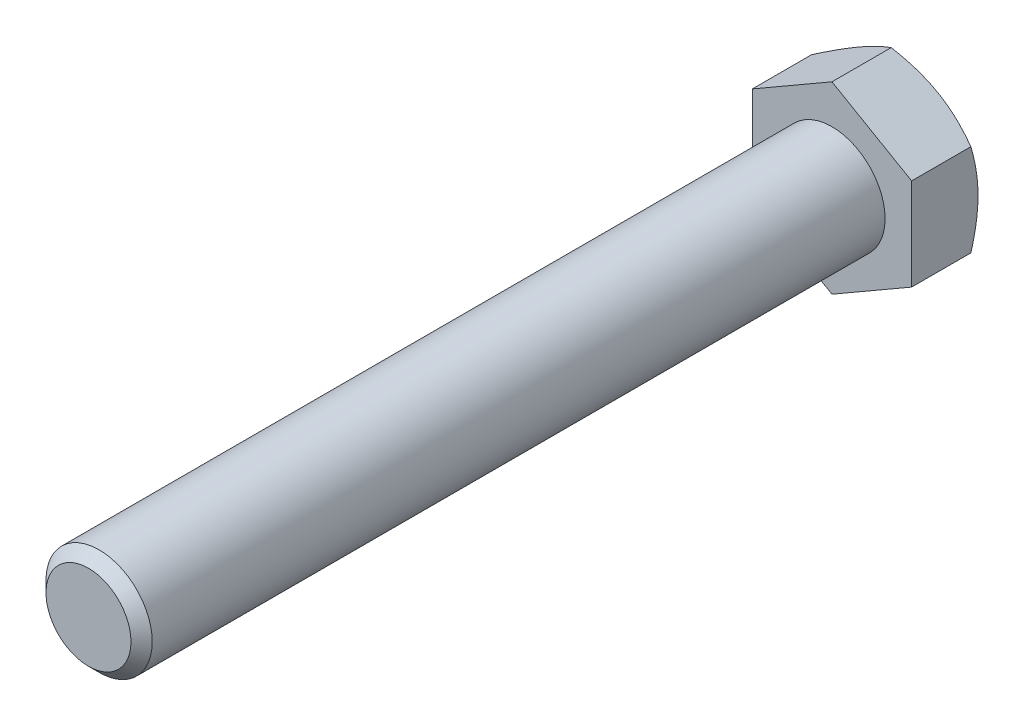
ISO-10303-21;
HEADER;
FILE_DESCRIPTION(('STEP AP214'),'2;1');
FILE_NAME('part.step','',(''),(''),'','','');
FILE_SCHEMA(('AUTOMOTIVE_DESIGN { 1 0 10303 214 1 1 1 1 }'));
ENDSEC;
DATA;
#1=APPLICATION_CONTEXT('core data for automotive mechanical design processes');
#2=APPLICATION_PROTOCOL_DEFINITION('international standard','automotive_design',2000,#1);
#3=PRODUCT_CONTEXT('',#1,'mechanical');
#4=PRODUCT('Part','Part','',(#3));
#5=PRODUCT_RELATED_PRODUCT_CATEGORY('part','',(#4));
#6=PRODUCT_DEFINITION_FORMATION('','',#4);
#7=PRODUCT_DEFINITION_CONTEXT('part definition',#1,'design');
#8=PRODUCT_DEFINITION('design','',#6,#7);
#9=PRODUCT_DEFINITION_SHAPE('','',#8);
#10=(LENGTH_UNIT() NAMED_UNIT(*) SI_UNIT(.MILLI.,.METRE.));
#11=(NAMED_UNIT(*) PLANE_ANGLE_UNIT() SI_UNIT($,.RADIAN.));
#12=(NAMED_UNIT(*) SI_UNIT($,.STERADIAN.) SOLID_ANGLE_UNIT());
#13=UNCERTAINTY_MEASURE_WITH_UNIT(LENGTH_MEASURE(1.E-05),#10,'distance_accuracy_value','');
#14=(GEOMETRIC_REPRESENTATION_CONTEXT(3) GLOBAL_UNCERTAINTY_ASSIGNED_CONTEXT((#13)) GLOBAL_UNIT_ASSIGNED_CONTEXT((#10,
#11,#12)) REPRESENTATION_CONTEXT('',''));
#15=CARTESIAN_POINT('',(0.,0.,0.));
#16=DIRECTION('',(0.,0.,1.));
#17=DIRECTION('',(1.,0.,0.));
#18=AXIS2_PLACEMENT_3D('',#15,#16,#17);
#19=CARTESIAN_POINT('',(0.,0.,140.));
#20=DIRECTION('',(0.,0.,1.));
#21=DIRECTION('',(1.,0.,0.));
#22=AXIS2_PLACEMENT_3D('',#19,#20,#21);
#23=PLANE('',#22);
#24=CARTESIAN_POINT('',(0.,0.,140.));
#25=DIRECTION('',(0.,0.,1.));
#26=DIRECTION('',(1.,0.,0.));
#27=AXIS2_PLACEMENT_3D('',#24,#25,#26);
#28=CIRCLE('',#27,8.00000000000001);
#29=CARTESIAN_POINT('',(8.00000000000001,0.,140.));
#30=VERTEX_POINT('',#29);
#31=EDGE_CURVE('E201',#30,#30,#28,.T.);
#32=ORIENTED_EDGE('',*,*,#31,.T.);
#33=EDGE_LOOP('',(#32));
#34=FACE_BOUND('',#33,.T.);
#35=ADVANCED_FACE('F27',(#34),#23,.T.);
#36=CARTESIAN_POINT('',(0.,0.,0.));
#37=DIRECTION('',(0.,0.,1.));
#38=DIRECTION('',(1.,0.,0.));
#39=AXIS2_PLACEMENT_3D('',#36,#37,#38);
#40=CYLINDRICAL_SURFACE('',#39,10.);
#41=CARTESIAN_POINT('',(0.,0.,138.));
#42=DIRECTION('',(0.,0.,1.));
#43=DIRECTION('',(1.,0.,0.));
#44=AXIS2_PLACEMENT_3D('',#41,#42,#43);
#45=CIRCLE('',#44,10.);
#46=CARTESIAN_POINT('',(10.,0.,138.));
#47=VERTEX_POINT('',#46);
#48=EDGE_CURVE('E203',#47,#47,#45,.F.);
#49=ORIENTED_EDGE('',*,*,#48,.T.);
#50=EDGE_LOOP('',(#49));
#51=FACE_BOUND('',#50,.T.);
#52=CARTESIAN_POINT('',(0.,0.,0.));
#53=DIRECTION('',(0.,0.,1.));
#54=DIRECTION('',(1.,0.,0.));
#55=AXIS2_PLACEMENT_3D('',#52,#53,#54);
#56=CIRCLE('',#55,10.);
#57=CARTESIAN_POINT('',(10.,0.,0.));
#58=VERTEX_POINT('',#57);
#59=EDGE_CURVE('E204',#58,#58,#56,.F.);
#60=ORIENTED_EDGE('',*,*,#59,.F.);
#61=EDGE_LOOP('',(#60));
#62=FACE_BOUND('',#61,.T.);
#63=ADVANCED_FACE('F192',(#51,#62),#40,.T.);
#64=CARTESIAN_POINT('',(0.,0.,140.));
#65=DIRECTION('',(0.,0.,-1.));
#66=DIRECTION('',(-1.,0.,0.));
#67=AXIS2_PLACEMENT_3D('',#64,#65,#66);
#68=CONICAL_SURFACE('',#67,8.00000000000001,0.785398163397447);
#69=ORIENTED_EDGE('',*,*,#48,.F.);
#70=EDGE_LOOP('',(#69));
#71=FACE_BOUND('',#70,.T.);
#72=ORIENTED_EDGE('',*,*,#31,.F.);
#73=EDGE_LOOP('',(#72));
#74=FACE_BOUND('',#73,.T.);
#75=ADVANCED_FACE('F197',(#71,#74),#68,.T.);
#76=CARTESIAN_POINT('',(-1.11022302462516E-13,17.3205080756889,-12.5));
#77=DIRECTION('',(0.499999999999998,0.86602540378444,0.));
#78=DIRECTION('',(-0.86602540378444,0.499999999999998,0.));
#79=AXIS2_PLACEMENT_3D('',#76,#77,#78);
#80=PLANE('',#79);
#81=CARTESIAN_POINT('',(-0.000200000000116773,17.3206235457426,-11.1601873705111));
#82=CARTESIAN_POINT('',(0.32949410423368,17.1302745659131,-11.270078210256));
#83=CARTESIAN_POINT('',(0.660474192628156,16.9391831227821,-11.3749824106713));
#84=CARTESIAN_POINT('',(1.32508844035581,16.5554679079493,-11.5734314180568));
#85=CARTESIAN_POINT('',(1.65872343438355,16.3628436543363,-11.6669724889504));
#86=CARTESIAN_POINT('',(2.3292922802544,15.9756905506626,-11.84143785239));
#87=CARTESIAN_POINT('',(2.66623200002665,15.7811583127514,-11.9223322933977));
#88=CARTESIAN_POINT('',(3.34245276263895,15.3907420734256,-12.0697673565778));
#89=CARTESIAN_POINT('',(3.68173367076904,15.1948581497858,-12.1363087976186));
#90=CARTESIAN_POINT('',(4.35394314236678,14.806757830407,-12.2522076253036));
#91=CARTESIAN_POINT('',(4.68682180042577,14.6145702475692,-12.3019486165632));
#92=CARTESIAN_POINT('',(5.35410443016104,14.229314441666,-12.3853532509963));
#93=CARTESIAN_POINT('',(5.68850843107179,14.036246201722,-12.4190165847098));
#94=CARTESIAN_POINT('',(6.35787818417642,13.6497853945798,-12.4694159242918));
#95=CARTESIAN_POINT('',(6.69284279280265,13.4563934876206,-12.4861720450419));
#96=CARTESIAN_POINT('',(7.36308121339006,13.0694311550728,-12.502396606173));
#97=CARTESIAN_POINT('',(7.69835501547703,12.8758607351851,-12.5018655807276));
#98=CARTESIAN_POINT('',(8.32514688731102,12.513982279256,-12.4847233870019));
#99=CARTESIAN_POINT('',(8.61670962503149,12.3456484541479,-12.470203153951));
#100=CARTESIAN_POINT('',(9.19916443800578,12.0093680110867,-12.4283628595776));
#101=CARTESIAN_POINT('',(9.49005646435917,11.8414214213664,-12.4010418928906));
#102=CARTESIAN_POINT('',(10.0710118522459,11.5060066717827,-12.3340764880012));
#103=CARTESIAN_POINT('',(10.3610743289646,11.3385390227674,-12.2944218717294));
#104=CARTESIAN_POINT('',(10.9398394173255,11.0043888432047,-12.2034848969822));
#105=CARTESIAN_POINT('',(11.228541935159,10.8377063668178,-12.1522017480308));
#106=CARTESIAN_POINT('',(12.10491443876,10.3317324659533,-11.9796131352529));
#107=CARTESIAN_POINT('',(12.690046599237,9.99390625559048,-11.8410988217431));
#108=CARTESIAN_POINT('',(13.8515859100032,9.32329122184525,-11.5267280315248));
#109=CARTESIAN_POINT('',(14.4280079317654,8.99049381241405,-11.3509453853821));
#110=CARTESIAN_POINT('',(15.0002,8.66013856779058,-11.160187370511));
#111=B_SPLINE_CURVE_WITH_KNOTS('',3,(#81,#82,#83,#84,#85,#86,#87,#88,#89,#90,#91,#92,#93,#94,
#95,#96,#97,#98,#99,#100,#101,#102,#103,#104,#105,#106,#107,#108,#109,#110),.UNSPECIFIED.,.F.,
.F.,(4,2,2,2,2,2,2,2,2,2,2,2,2,2,4),(0.,1.1887541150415,2.3778980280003,3.56980778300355,
4.76164951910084,5.92407379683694,7.08652044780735,8.24758247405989,9.40860862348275,
10.4193068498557,11.4300765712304,12.4416826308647,13.4533574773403,15.5211962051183,
17.5849760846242),.UNSPECIFIED.);
#112=CARTESIAN_POINT('',(-1.11022302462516E-13,17.3205080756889,-11.1602540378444));
#113=VERTEX_POINT('',#112);
#114=CARTESIAN_POINT('',(7.49999999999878,12.9903810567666,-12.5));
#115=VERTEX_POINT('',#114);
#116=EDGE_CURVE('E237',#113,#115,#111,.T.);
#117=ORIENTED_EDGE('',*,*,#116,.F.);
#118=DIRECTION('',(0.,0.,1.));
#119=VECTOR('',#118,1.);
#120=CARTESIAN_POINT('',(-1.11022302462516E-13,17.3205080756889,-12.5));
#121=LINE('',#120,#119);
#122=CARTESIAN_POINT('',(-1.27675647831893E-12,17.3205080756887,0.));
#123=VERTEX_POINT('',#122);
#124=EDGE_CURVE('E211',#113,#123,#121,.T.);
#125=ORIENTED_EDGE('',*,*,#124,.T.);
#126=DIRECTION('',(-0.86602540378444,0.499999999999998,0.));
#127=VECTOR('',#126,1.);
#128=CARTESIAN_POINT('',(-1.27675647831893E-12,17.3205080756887,0.));
#129=LINE('',#128,#127);
#130=CARTESIAN_POINT('',(15.,8.66025403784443,0.));
#131=VERTEX_POINT('',#130);
#132=EDGE_CURVE('E235',#131,#123,#129,.T.);
#133=ORIENTED_EDGE('',*,*,#132,.F.);
#134=DIRECTION('',(0.,0.,1.));
#135=VECTOR('',#134,1.);
#136=CARTESIAN_POINT('',(15.,8.66025403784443,-12.5));
#137=LINE('',#136,#135);
#138=CARTESIAN_POINT('',(15.,8.66025403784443,-11.1602540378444));
#139=VERTEX_POINT('',#138);
#140=EDGE_CURVE('E208',#139,#131,#137,.T.);
#141=ORIENTED_EDGE('',*,*,#140,.F.);
#142=EDGE_CURVE('E167',#115,#139,#111,.T.);
#143=ORIENTED_EDGE('',*,*,#142,.F.);
#144=EDGE_LOOP('',(#117,#125,#133,#141,#143));
#145=FACE_BOUND('',#144,.T.);
#146=ADVANCED_FACE('F177',(#145),#80,.T.);
#147=CARTESIAN_POINT('',(15.,-8.66025403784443,-12.5));
#148=DIRECTION('',(1.,0.,0.));
#149=DIRECTION('',(0.,0.,-1.));
#150=AXIS2_PLACEMENT_3D('',#147,#148,#149);
#151=PLANE('',#150);
#152=CARTESIAN_POINT('',(14.9999999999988,-23.6563424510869,-4.98802951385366));
#153=CARTESIAN_POINT('',(14.9999999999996,-23.3270368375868,-5.14859323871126));
#154=CARTESIAN_POINT('',(14.9999999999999,-22.9973552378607,-5.30838548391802));
#155=CARTESIAN_POINT('',(15.0000000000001,-22.3371617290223,-5.62625300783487));
#156=CARTESIAN_POINT('',(15.0000000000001,-22.0066498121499,-5.7843282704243));
#157=CARTESIAN_POINT('',(14.9999999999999,-21.0136682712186,-6.25575678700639));
#158=CARTESIAN_POINT('',(15.,-20.3498444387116,-6.56626799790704));
#159=CARTESIAN_POINT('',(15.,-19.0144565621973,-7.1794948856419));
#160=CARTESIAN_POINT('',(15.,-18.3428702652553,-7.48216221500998));
#161=CARTESIAN_POINT('',(15.,-16.9944919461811,-8.07562821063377));
#162=CARTESIAN_POINT('',(15.,-16.3177001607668,-8.36642741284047));
#163=CARTESIAN_POINT('',(15.,-14.9346939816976,-8.9426707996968));
#164=CARTESIAN_POINT('',(15.,-14.2282621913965,-9.22759584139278));
#165=CARTESIAN_POINT('',(15.,-12.8072761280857,-9.77682099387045));
#166=CARTESIAN_POINT('',(15.,-12.0927209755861,-10.0411188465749));
#167=CARTESIAN_POINT('',(15.,-10.6555877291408,-10.5424349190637));
#168=CARTESIAN_POINT('',(15.,-9.93302789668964,-10.7795050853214));
#169=CARTESIAN_POINT('',(15.,-8.47748492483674,-11.2190363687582));
#170=CARTESIAN_POINT('',(15.,-7.74450501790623,-11.4215079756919));
#171=CARTESIAN_POINT('',(15.,-6.63906626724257,-11.691591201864));
#172=CARTESIAN_POINT('',(15.,-6.27064605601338,-11.7758229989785));
#173=CARTESIAN_POINT('',(15.,-5.5312182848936,-11.9321086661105));
#174=CARTESIAN_POINT('',(15.,-5.16021077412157,-12.0041627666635));
#175=CARTESIAN_POINT('',(15.,-4.41583632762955,-12.1348466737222));
#176=CARTESIAN_POINT('',(15.,-4.04246944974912,-12.1934768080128));
#177=CARTESIAN_POINT('',(15.,-3.29373978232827,-12.2961594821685));
#178=CARTESIAN_POINT('',(15.,-2.91837708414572,-12.3402126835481));
#179=CARTESIAN_POINT('',(15.,-2.17125057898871,-12.4122914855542));
#180=CARTESIAN_POINT('',(15.,-1.79950710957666,-12.4405265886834));
#181=CARTESIAN_POINT('',(15.,-1.05515863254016,-12.4812352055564));
#182=CARTESIAN_POINT('',(15.,-0.682553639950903,-12.4937089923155));
#183=CARTESIAN_POINT('',(15.,0.0628536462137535,-12.5025960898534));
#184=CARTESIAN_POINT('',(15.,0.435655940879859,-12.4990093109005));
#185=CARTESIAN_POINT('',(15.,1.18076829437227,-12.4758669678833));
#186=CARTESIAN_POINT('',(15.,1.55307833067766,-12.456310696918));
#187=CARTESIAN_POINT('',(15.,2.4360458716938,-12.3914173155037));
#188=CARTESIAN_POINT('',(15.,2.94620665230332,-12.3391608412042));
#189=CARTESIAN_POINT('',(15.,3.96297341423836,-12.2074265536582));
#190=CARTESIAN_POINT('',(15.,4.46957894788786,-12.1279453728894));
#191=CARTESIAN_POINT('',(15.,5.9833388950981,-11.8528606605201));
#192=CARTESIAN_POINT('',(15.,6.9839432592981,-11.6206572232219));
#193=CARTESIAN_POINT('',(15.,8.48096930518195,-11.2149672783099));
#194=CARTESIAN_POINT('',(15.,8.98506717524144,-11.0681521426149));
#195=CARTESIAN_POINT('',(15.,9.98837333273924,-10.7585239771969));
#196=CARTESIAN_POINT('',(15.0000000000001,10.4875815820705,-10.5957108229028));
#197=CARTESIAN_POINT('',(15.,11.4812605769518,-10.2567587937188));
#198=CARTESIAN_POINT('',(14.9999999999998,11.9757325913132,-10.0806236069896));
#199=CARTESIAN_POINT('',(15.0000000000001,12.7143247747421,-9.80804005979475));
#200=CARTESIAN_POINT('',(15.0000000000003,12.9600014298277,-9.71578264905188));
#201=CARTESIAN_POINT('',(14.9999999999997,13.4503781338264,-9.52870505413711));
#202=CARTESIAN_POINT('',(14.999999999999,13.6950781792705,-9.43388486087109));
#203=CARTESIAN_POINT('',(14.9999999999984,14.3593902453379,-9.1727978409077));
#204=CARTESIAN_POINT('',(14.9999999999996,14.7781022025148,-9.00423842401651));
#205=CARTESIAN_POINT('',(15.0000000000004,15.6130793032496,-8.66115582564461));
#206=CARTESIAN_POINT('',(15.0000000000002,16.0293443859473,-8.48663249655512));
#207=CARTESIAN_POINT('',(14.9999999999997,17.2749256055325,-7.95534410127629));
#208=CARTESIAN_POINT('',(14.9999999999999,18.1009632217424,-7.5908862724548));
#209=CARTESIAN_POINT('',(15.0000000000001,19.7463472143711,-6.84641952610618));
#210=CARTESIAN_POINT('',(15.,20.5656908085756,-6.46640450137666));
#211=CARTESIAN_POINT('',(15.,22.1987342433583,-5.6945498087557));
#212=CARTESIAN_POINT('',(15.,23.0124343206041,-5.30271064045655));
#213=CARTESIAN_POINT('',(15.,24.6366504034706,-4.50915614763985));
#214=CARTESIAN_POINT('',(15.,25.4471589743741,-4.10742564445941));
#215=CARTESIAN_POINT('',(15.,27.0645048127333,-3.29663533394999));
#216=CARTESIAN_POINT('',(15.,27.8713420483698,-2.88757546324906));
#217=CARTESIAN_POINT('',(15.,29.481823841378,-2.06366878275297));
#218=CARTESIAN_POINT('',(15.,30.2854690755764,-1.64882329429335));
#219=CARTESIAN_POINT('',(15.,31.890265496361,-0.814347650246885));
#220=CARTESIAN_POINT('',(15.,32.691416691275,-0.39471751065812));
#221=CARTESIAN_POINT('',(15.,34.9203498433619,0.779727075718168));
#222=CARTESIAN_POINT('',(15.,36.3458714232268,1.53883048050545));
#223=CARTESIAN_POINT('',(15.,39.1921522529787,3.06610948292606));
#224=CARTESIAN_POINT('',(15.,40.6129111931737,3.83428565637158));
#225=CARTESIAN_POINT('',(15.,43.445900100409,5.37475686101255));
#226=CARTESIAN_POINT('',(15.,44.858142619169,6.14702882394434));
#227=CARTESIAN_POINT('',(15.,46.9743278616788,7.30926449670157));
#228=CARTESIAN_POINT('',(15.,47.6793316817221,7.69729873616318));
#229=CARTESIAN_POINT('',(15.,49.0887078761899,8.47451029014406));
#230=CARTESIAN_POINT('',(15.,49.7930802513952,8.86368760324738));
#231=CARTESIAN_POINT('',(15.,50.4971756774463,9.25336545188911));
#232=B_SPLINE_CURVE_WITH_KNOTS('',3,(#152,#153,#154,#155,#156,#157,#158,#159,#160,#161,#162,
#163,#164,#165,#166,#167,#168,#169,#170,#171,#172,#173,#174,#175,#176,#177,#178,#179,#180,#181,
#182,#183,#184,#185,#186,#187,#188,#189,#190,#191,#192,#193,#194,#195,#196,#197,#198,#199,#200,
#201,#202,#203,#204,#205,#206,#207,#208,#209,#210,#211,#212,#213,#214,#215,#216,#217,#218,#219,
#220,#221,#222,#223,#224,#225,#226,#227,#228,#229,#230,#231),.UNSPECIFIED.,.F.,.F.,(4,2,2,2,2,2,
2,2,2,2,2,2,2,2,2,2,2,2,2,2,2,2,2,2,2,2,2,2,2,2,2,2,2,2,2,2,2,2,2,4),(0.,1.09909142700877,
2.19819316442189,4.39670244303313,6.60652703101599,8.81625171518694,11.1011868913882,
13.3863718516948,15.667121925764,17.9471792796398,19.0807901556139,20.2143795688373,
21.3479412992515,22.4814515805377,23.5995709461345,24.7176709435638,25.8357771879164,
26.9539329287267,28.4915630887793,30.0293835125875,33.1065029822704,34.6814865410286,
36.2564823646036,37.8310437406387,38.6183151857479,39.4055894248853,40.7596309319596,
42.1137059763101,44.8220642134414,47.5314960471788,50.2408135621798,52.9545856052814,
55.668381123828,58.3815666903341,61.0947431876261,65.939807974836,70.7851819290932,
75.6139863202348,78.0281952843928,80.4424012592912),.UNSPECIFIED.);
#233=CARTESIAN_POINT('',(15.,0.,-12.5000000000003));
#234=VERTEX_POINT('',#233);
#235=EDGE_CURVE('E165',#139,#234,#232,.F.);
#236=ORIENTED_EDGE('',*,*,#235,.F.);
#237=ORIENTED_EDGE('',*,*,#140,.T.);
#238=DIRECTION('',(0.,1.,0.));
#239=VECTOR('',#238,1.);
#240=CARTESIAN_POINT('',(15.,-8.66025403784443,0.));
#241=LINE('',#240,#239);
#242=CARTESIAN_POINT('',(15.,-8.66025403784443,0.));
#243=VERTEX_POINT('',#242);
#244=EDGE_CURVE('E213',#243,#131,#241,.T.);
#245=ORIENTED_EDGE('',*,*,#244,.F.);
#246=DIRECTION('',(0.,0.,1.));
#247=VECTOR('',#246,1.);
#248=CARTESIAN_POINT('',(15.,-8.66025403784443,-12.5));
#249=LINE('',#248,#247);
#250=CARTESIAN_POINT('',(15.,-8.66025403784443,-11.1602540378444));
#251=VERTEX_POINT('',#250);
#252=EDGE_CURVE('E219',#251,#243,#249,.T.);
#253=ORIENTED_EDGE('',*,*,#252,.F.);
#254=EDGE_CURVE('E160',#234,#251,#232,.F.);
#255=ORIENTED_EDGE('',*,*,#254,.F.);
#256=EDGE_LOOP('',(#236,#237,#245,#253,#255));
#257=FACE_BOUND('',#256,.T.);
#258=ADVANCED_FACE('F173',(#257),#151,.T.);
#259=CARTESIAN_POINT('',(-1.11022302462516E-13,-17.3205080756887,-12.5));
#260=DIRECTION('',(0.499999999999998,-0.86602540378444,0.));
#261=DIRECTION('',(0.86602540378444,0.499999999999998,0.));
#262=AXIS2_PLACEMENT_3D('',#259,#260,#261);
#263=PLANE('',#262);
#264=CARTESIAN_POINT('',(15.0002,-8.66013856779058,-11.1601873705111));
#265=CARTESIAN_POINT('',(14.6705058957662,-8.85048754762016,-11.2700782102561));
#266=CARTESIAN_POINT('',(14.3395258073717,-9.04157899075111,-11.3749824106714));
#267=CARTESIAN_POINT('',(13.674911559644,-9.42529420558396,-11.5734314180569));
#268=CARTESIAN_POINT('',(13.3412765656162,-9.61791845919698,-11.6669724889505));
#269=CARTESIAN_POINT('',(12.6707077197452,-10.0050715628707,-11.8414378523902));
#270=CARTESIAN_POINT('',(12.333767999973,-10.1996038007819,-11.9223322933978));
#271=CARTESIAN_POINT('',(11.6575472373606,-10.5900200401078,-12.069767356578));
#272=CARTESIAN_POINT('',(11.3182663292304,-10.7859039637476,-12.1363087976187));
#273=CARTESIAN_POINT('',(10.6460568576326,-11.1740042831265,-12.2522076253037));
#274=CARTESIAN_POINT('',(10.3131781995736,-11.3661918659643,-12.3019486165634));
#275=CARTESIAN_POINT('',(9.64589556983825,-11.7514476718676,-12.3853532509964));
#276=CARTESIAN_POINT('',(9.31149156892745,-11.9445159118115,-12.4190165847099));
#277=CARTESIAN_POINT('',(8.64212181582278,-12.3309767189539,-12.469415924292));
#278=CARTESIAN_POINT('',(8.30715720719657,-12.5243686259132,-12.486172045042));
#279=CARTESIAN_POINT('',(7.63691878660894,-12.9113309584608,-12.5023966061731));
#280=CARTESIAN_POINT('',(7.30164498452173,-13.1049013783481,-12.5018655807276));
#281=CARTESIAN_POINT('',(6.67485311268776,-13.4667798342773,-12.4847233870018));
#282=CARTESIAN_POINT('',(6.3832903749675,-13.6351136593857,-12.470203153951));
#283=CARTESIAN_POINT('',(5.80083556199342,-13.971394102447,-12.4283628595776));
#284=CARTESIAN_POINT('',(5.50994353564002,-14.1393406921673,-12.4010418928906));
#285=CARTESIAN_POINT('',(4.92898814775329,-14.4747554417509,-12.3340764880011));
#286=CARTESIAN_POINT('',(4.63892567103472,-14.6422230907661,-12.2944218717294));
#287=CARTESIAN_POINT('',(4.06016058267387,-14.9763732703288,-12.2034848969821));
#288=CARTESIAN_POINT('',(3.77145806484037,-15.1430557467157,-12.1522017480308));
#289=CARTESIAN_POINT('',(2.89508556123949,-15.6490296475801,-11.9796131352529));
#290=CARTESIAN_POINT('',(2.30995340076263,-15.9868558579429,-11.8410988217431));
#291=CARTESIAN_POINT('',(1.14841408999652,-16.657470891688,-11.5267280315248));
#292=CARTESIAN_POINT('',(0.571992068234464,-16.9902683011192,-11.3509453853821));
#293=CARTESIAN_POINT('',(-0.000200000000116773,-17.3206235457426,-11.160187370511));
#294=B_SPLINE_CURVE_WITH_KNOTS('',3,(#264,#265,#266,#267,#268,#269,#270,#271,#272,#273,#274,
#275,#276,#277,#278,#279,#280,#281,#282,#283,#284,#285,#286,#287,#288,#289,#290,#291,#292,#293),
.UNSPECIFIED.,.F.,.F.,(4,2,2,2,2,2,2,2,2,2,2,2,2,2,4),(0.,1.18875411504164,2.37789802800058,
3.56980778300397,4.76164951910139,5.92407379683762,7.08652044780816,8.24758247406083,
9.40860862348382,10.4193068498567,11.4300765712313,12.4416826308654,13.4533574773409,
15.5211962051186,17.5849760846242),.UNSPECIFIED.);
#295=CARTESIAN_POINT('',(7.49999999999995,-12.9903810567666,-12.5));
#296=VERTEX_POINT('',#295);
#297=EDGE_CURVE('E166',#251,#296,#294,.T.);
#298=ORIENTED_EDGE('',*,*,#297,.F.);
#299=ORIENTED_EDGE('',*,*,#252,.T.);
#300=DIRECTION('',(0.86602540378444,0.499999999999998,0.));
#301=VECTOR('',#300,1.);
#302=CARTESIAN_POINT('',(-1.11022302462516E-13,-17.3205080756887,0.));
#303=LINE('',#302,#301);
#304=CARTESIAN_POINT('',(-1.11022302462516E-13,-17.3205080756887,0.));
#305=VERTEX_POINT('',#304);
#306=EDGE_CURVE('E224',#305,#243,#303,.T.);
#307=ORIENTED_EDGE('',*,*,#306,.F.);
#308=DIRECTION('',(0.,0.,1.));
#309=VECTOR('',#308,1.);
#310=CARTESIAN_POINT('',(-1.11022302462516E-13,-17.3205080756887,-12.5));
#311=LINE('',#310,#309);
#312=CARTESIAN_POINT('',(-1.11022302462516E-13,-17.3205080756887,-11.1602540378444));
#313=VERTEX_POINT('',#312);
#314=EDGE_CURVE('E217',#313,#305,#311,.T.);
#315=ORIENTED_EDGE('',*,*,#314,.F.);
#316=EDGE_CURVE('E154',#296,#313,#294,.T.);
#317=ORIENTED_EDGE('',*,*,#316,.F.);
#318=EDGE_LOOP('',(#298,#299,#307,#315,#317));
#319=FACE_BOUND('',#318,.T.);
#320=ADVANCED_FACE('F176',(#319),#263,.T.);
#321=CARTESIAN_POINT('',(-1.11022302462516E-13,-17.3205080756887,-12.5));
#322=DIRECTION('',(-0.500000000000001,-0.866025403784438,0.));
#323=DIRECTION('',(0.866025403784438,-0.500000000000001,0.));
#324=AXIS2_PLACEMENT_3D('',#321,#322,#323);
#325=PLANE('',#324);
#326=CARTESIAN_POINT('',(0.000199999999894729,-17.3206235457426,-11.160187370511));
#327=CARTESIAN_POINT('',(-0.329494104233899,-17.130274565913,-11.2700782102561));
#328=CARTESIAN_POINT('',(-0.660474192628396,-16.939183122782,-11.3749824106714));
#329=CARTESIAN_POINT('',(-1.32508844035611,-16.5554679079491,-11.5734314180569));
#330=CARTESIAN_POINT('',(-1.6587234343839,-16.3628436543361,-11.6669724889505));
#331=CARTESIAN_POINT('',(-2.32929228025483,-15.9756905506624,-11.8414378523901));
#332=CARTESIAN_POINT('',(-2.66623200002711,-15.7811583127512,-11.9223322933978));
#333=CARTESIAN_POINT('',(-3.34245276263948,-15.3907420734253,-12.069767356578));
#334=CARTESIAN_POINT('',(-3.68173367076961,-15.1948581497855,-12.1363087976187));
#335=CARTESIAN_POINT('',(-4.35394314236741,-14.8067578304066,-12.2522076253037));
#336=CARTESIAN_POINT('',(-4.68682180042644,-14.6145702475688,-12.3019486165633));
#337=CARTESIAN_POINT('',(-5.3541044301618,-14.2293144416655,-12.3853532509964));
#338=CARTESIAN_POINT('',(-5.68850843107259,-14.0362462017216,-12.4190165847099));
#339=CARTESIAN_POINT('',(-6.35787818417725,-13.6497853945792,-12.4694159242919));
#340=CARTESIAN_POINT('',(-6.69284279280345,-13.4563934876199,-12.4861720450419));
#341=CARTESIAN_POINT('',(-7.36308121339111,-13.0694311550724,-12.502396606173));
#342=CARTESIAN_POINT('',(-7.69835501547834,-12.8758607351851,-12.5018655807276));
#343=CARTESIAN_POINT('',(-8.3251468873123,-12.5139822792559,-12.4847233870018));
#344=CARTESIAN_POINT('',(-8.61670962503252,-12.3456484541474,-12.470203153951));
#345=CARTESIAN_POINT('',(-9.19916443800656,-12.0093680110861,-12.4283628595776));
#346=CARTESIAN_POINT('',(-9.49005646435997,-11.8414214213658,-12.4010418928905));
#347=CARTESIAN_POINT('',(-10.0710118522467,-11.5060066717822,-12.3340764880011));
#348=CARTESIAN_POINT('',(-10.3610743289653,-11.338539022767,-12.2944218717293));
#349=CARTESIAN_POINT('',(-10.9398394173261,-11.0043888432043,-12.2034848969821));
#350=CARTESIAN_POINT('',(-11.2285419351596,-10.8377063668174,-12.1522017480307));
#351=CARTESIAN_POINT('',(-12.1049144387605,-10.3317324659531,-11.9796131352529));
#352=CARTESIAN_POINT('',(-12.6900465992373,-9.99390625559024,-11.841098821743));
#353=CARTESIAN_POINT('',(-13.8515859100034,-9.3232912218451,-11.5267280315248));
#354=CARTESIAN_POINT('',(-14.4280079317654,-8.99049381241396,-11.3509453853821));
#355=CARTESIAN_POINT('',(-15.0002,-8.66013856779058,-11.1601873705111));
#356=B_SPLINE_CURVE_WITH_KNOTS('',3,(#326,#327,#328,#329,#330,#331,#332,#333,#334,#335,#336,
#337,#338,#339,#340,#341,#342,#343,#344,#345,#346,#347,#348,#349,#350,#351,#352,#353,#354,#355),
.UNSPECIFIED.,.F.,.F.,(4,2,2,2,2,2,2,2,2,2,2,2,2,2,4),(0.,1.18875411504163,2.37789802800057,
3.56980778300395,4.76164951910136,5.92407379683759,7.08652044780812,8.24758247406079,
9.40860862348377,10.4193068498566,11.4300765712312,12.4416826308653,13.4533574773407,
15.5211962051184,17.584976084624),.UNSPECIFIED.);
#357=CARTESIAN_POINT('',(-7.50000000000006,-12.9903810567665,-12.5));
#358=VERTEX_POINT('',#357);
#359=EDGE_CURVE('E256',#313,#358,#356,.T.);
#360=ORIENTED_EDGE('',*,*,#359,.F.);
#361=ORIENTED_EDGE('',*,*,#314,.T.);
#362=DIRECTION('',(0.866025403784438,-0.500000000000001,0.));
#363=VECTOR('',#362,1.);
#364=CARTESIAN_POINT('',(-1.11022302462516E-13,-17.3205080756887,0.));
#365=LINE('',#364,#363);
#366=CARTESIAN_POINT('',(-15.,-8.66025403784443,0.));
#367=VERTEX_POINT('',#366);
#368=EDGE_CURVE('E227',#367,#305,#365,.T.);
#369=ORIENTED_EDGE('',*,*,#368,.F.);
#370=DIRECTION('',(0.,0.,1.));
#371=VECTOR('',#370,1.);
#372=CARTESIAN_POINT('',(-15.,-8.66025403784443,-12.5));
#373=LINE('',#372,#371);
#374=CARTESIAN_POINT('',(-15.,-8.66025403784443,-11.1602540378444));
#375=VERTEX_POINT('',#374);
#376=EDGE_CURVE('E215',#375,#367,#373,.T.);
#377=ORIENTED_EDGE('',*,*,#376,.F.);
#378=EDGE_CURVE('E103',#358,#375,#356,.T.);
#379=ORIENTED_EDGE('',*,*,#378,.F.);
#380=EDGE_LOOP('',(#360,#361,#369,#377,#379));
#381=FACE_BOUND('',#380,.T.);
#382=ADVANCED_FACE('F181',(#381),#325,.T.);
#383=CARTESIAN_POINT('',(-15.,-8.66025403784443,-12.5));
#384=DIRECTION('',(-1.,0.,0.));
#385=DIRECTION('',(0.,0.,1.));
#386=AXIS2_PLACEMENT_3D('',#383,#384,#385);
#387=PLANE('',#386);
#388=CARTESIAN_POINT('',(-15.0000000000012,-23.6563424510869,-4.98802951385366));
#389=CARTESIAN_POINT('',(-15.0000000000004,-23.3270368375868,-5.14859323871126));
#390=CARTESIAN_POINT('',(-15.0000000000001,-22.9973552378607,-5.30838548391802));
#391=CARTESIAN_POINT('',(-14.9999999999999,-22.3371617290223,-5.62625300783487));
#392=CARTESIAN_POINT('',(-15.,-22.0066498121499,-5.7843282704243));
#393=CARTESIAN_POINT('',(-15.0000000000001,-21.0136682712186,-6.25575678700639));
#394=CARTESIAN_POINT('',(-15.,-20.3498444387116,-6.56626799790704));
#395=CARTESIAN_POINT('',(-15.,-19.0144565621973,-7.1794948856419));
#396=CARTESIAN_POINT('',(-15.,-18.3428702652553,-7.48216221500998));
#397=CARTESIAN_POINT('',(-15.,-16.9944919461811,-8.07562821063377));
#398=CARTESIAN_POINT('',(-15.,-16.3177001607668,-8.36642741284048));
#399=CARTESIAN_POINT('',(-15.,-14.9346939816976,-8.94267079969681));
#400=CARTESIAN_POINT('',(-15.,-14.2282621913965,-9.22759584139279));
#401=CARTESIAN_POINT('',(-15.,-12.8072761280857,-9.77682099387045));
#402=CARTESIAN_POINT('',(-15.,-12.0927209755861,-10.0411188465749));
#403=CARTESIAN_POINT('',(-15.,-10.6555877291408,-10.5424349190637));
#404=CARTESIAN_POINT('',(-15.,-9.93302789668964,-10.7795050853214));
#405=CARTESIAN_POINT('',(-15.,-8.47748492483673,-11.2190363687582));
#406=CARTESIAN_POINT('',(-15.,-7.74450501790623,-11.4215079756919));
#407=CARTESIAN_POINT('',(-15.,-6.63906626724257,-11.691591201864));
#408=CARTESIAN_POINT('',(-15.,-6.27064605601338,-11.7758229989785));
#409=CARTESIAN_POINT('',(-15.,-5.5312182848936,-11.9321086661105));
#410=CARTESIAN_POINT('',(-15.,-5.16021077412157,-12.0041627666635));
#411=CARTESIAN_POINT('',(-15.,-4.41583632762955,-12.1348466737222));
#412=CARTESIAN_POINT('',(-15.,-4.04246944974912,-12.1934768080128));
#413=CARTESIAN_POINT('',(-15.,-3.29373978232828,-12.2961594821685));
#414=CARTESIAN_POINT('',(-15.,-2.91837708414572,-12.3402126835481));
#415=CARTESIAN_POINT('',(-15.,-2.17125057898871,-12.4122914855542));
#416=CARTESIAN_POINT('',(-15.,-1.79950710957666,-12.4405265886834));
#417=CARTESIAN_POINT('',(-15.,-1.05515863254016,-12.4812352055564));
#418=CARTESIAN_POINT('',(-15.,-0.682553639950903,-12.4937089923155));
#419=CARTESIAN_POINT('',(-15.,0.0628536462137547,-12.5025960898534));
#420=CARTESIAN_POINT('',(-15.,0.435655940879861,-12.4990093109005));
#421=CARTESIAN_POINT('',(-15.,1.18076829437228,-12.4758669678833));
#422=CARTESIAN_POINT('',(-15.,1.55307833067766,-12.456310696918));
#423=CARTESIAN_POINT('',(-15.,2.4360458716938,-12.3914173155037));
#424=CARTESIAN_POINT('',(-15.,2.94620665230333,-12.3391608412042));
#425=CARTESIAN_POINT('',(-15.,3.96297341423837,-12.2074265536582));
#426=CARTESIAN_POINT('',(-15.,4.46957894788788,-12.1279453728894));
#427=CARTESIAN_POINT('',(-15.,5.98333889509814,-11.85286066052));
#428=CARTESIAN_POINT('',(-15.,6.98394325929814,-11.6206572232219));
#429=CARTESIAN_POINT('',(-15.,8.480969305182,-11.2149672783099));
#430=CARTESIAN_POINT('',(-15.,8.9850671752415,-11.0681521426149));
#431=CARTESIAN_POINT('',(-15.,9.98837333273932,-10.7585239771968));
#432=CARTESIAN_POINT('',(-15.,10.4875815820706,-10.5957108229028));
#433=CARTESIAN_POINT('',(-15.0000000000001,11.4812605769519,-10.2567587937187));
#434=CARTESIAN_POINT('',(-15.0000000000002,11.9757325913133,-10.0806236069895));
#435=CARTESIAN_POINT('',(-14.9999999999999,12.7143247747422,-9.80804005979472));
#436=CARTESIAN_POINT('',(-14.9999999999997,12.9600014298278,-9.71578264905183));
#437=CARTESIAN_POINT('',(-15.0000000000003,13.4503781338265,-9.52870505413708));
#438=CARTESIAN_POINT('',(-15.000000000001,13.6950781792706,-9.43388486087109));
#439=CARTESIAN_POINT('',(-15.0000000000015,14.359390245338,-9.17279784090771));
#440=CARTESIAN_POINT('',(-15.0000000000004,14.7781022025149,-9.00423842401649));
#441=CARTESIAN_POINT('',(-14.9999999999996,15.6130793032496,-8.66115582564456));
#442=CARTESIAN_POINT('',(-14.9999999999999,16.0293443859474,-8.48663249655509));
#443=CARTESIAN_POINT('',(-15.0000000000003,17.2749256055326,-7.95534410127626));
#444=CARTESIAN_POINT('',(-15.0000000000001,18.1009632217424,-7.59088627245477));
#445=CARTESIAN_POINT('',(-14.9999999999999,19.7463472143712,-6.84641952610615));
#446=CARTESIAN_POINT('',(-15.,20.5656908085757,-6.46640450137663));
#447=CARTESIAN_POINT('',(-15.,22.1987342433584,-5.69454980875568));
#448=CARTESIAN_POINT('',(-15.,23.0124343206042,-5.30271064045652));
#449=CARTESIAN_POINT('',(-15.,24.6366504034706,-4.50915614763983));
#450=CARTESIAN_POINT('',(-15.,25.4471589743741,-4.10742564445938));
#451=CARTESIAN_POINT('',(-15.,27.0645048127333,-3.29663533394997));
#452=CARTESIAN_POINT('',(-15.,27.8713420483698,-2.88757546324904));
#453=CARTESIAN_POINT('',(-15.,29.4818238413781,-2.06366878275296));
#454=CARTESIAN_POINT('',(-15.,30.2854690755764,-1.64882329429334));
#455=CARTESIAN_POINT('',(-15.,31.890265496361,-0.814347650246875));
#456=CARTESIAN_POINT('',(-15.,32.691416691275,-0.39471751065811));
#457=CARTESIAN_POINT('',(-15.,34.9203498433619,0.779727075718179));
#458=CARTESIAN_POINT('',(-15.,36.3458714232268,1.53883048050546));
#459=CARTESIAN_POINT('',(-15.,39.1921522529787,3.06610948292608));
#460=CARTESIAN_POINT('',(-15.,40.6129111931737,3.83428565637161));
#461=CARTESIAN_POINT('',(-15.,43.4459001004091,5.37475686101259));
#462=CARTESIAN_POINT('',(-15.,44.8581426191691,6.14702882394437));
#463=CARTESIAN_POINT('',(-15.,46.9743278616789,7.30926449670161));
#464=CARTESIAN_POINT('',(-15.,47.6793316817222,7.69729873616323));
#465=CARTESIAN_POINT('',(-15.,49.08870787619,8.4745102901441));
#466=CARTESIAN_POINT('',(-15.,49.7930802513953,8.86368760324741));
#467=CARTESIAN_POINT('',(-15.,50.4971756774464,9.2533654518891));
#468=B_SPLINE_CURVE_WITH_KNOTS('',3,(#388,#389,#390,#391,#392,#393,#394,#395,#396,#397,#398,
#399,#400,#401,#402,#403,#404,#405,#406,#407,#408,#409,#410,#411,#412,#413,#414,#415,#416,#417,
#418,#419,#420,#421,#422,#423,#424,#425,#426,#427,#428,#429,#430,#431,#432,#433,#434,#435,#436,
#437,#438,#439,#440,#441,#442,#443,#444,#445,#446,#447,#448,#449,#450,#451,#452,#453,#454,#455,
#456,#457,#458,#459,#460,#461,#462,#463,#464,#465,#466,#467),.UNSPECIFIED.,.F.,.F.,(4,2,2,2,2,2,
2,2,2,2,2,2,2,2,2,2,2,2,2,2,2,2,2,2,2,2,2,2,2,2,2,2,2,2,2,2,2,2,2,4),(0.,1.09909142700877,
2.1981931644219,4.39670244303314,6.606527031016,8.81625171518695,11.1011868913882,
13.3863718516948,15.667121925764,17.9471792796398,19.0807901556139,20.2143795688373,
21.3479412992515,22.4814515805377,23.5995709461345,24.7176709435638,25.8357771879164,
26.9539329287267,28.4915630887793,30.0293835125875,33.1065029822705,34.6814865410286,
36.2564823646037,37.8310437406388,38.618315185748,39.4055894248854,40.7596309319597,
42.1137059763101,44.8220642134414,47.5314960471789,50.2408135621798,52.9545856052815,
55.668381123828,58.3815666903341,61.0947431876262,65.939807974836,70.7851819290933,
75.6139863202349,78.0281952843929,80.4424012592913),.UNSPECIFIED.);
#469=CARTESIAN_POINT('',(-15.,0.,-12.5));
#470=VERTEX_POINT('',#469);
#471=EDGE_CURVE('E98',#375,#470,#468,.T.);
#472=ORIENTED_EDGE('',*,*,#471,.F.);
#473=ORIENTED_EDGE('',*,*,#376,.T.);
#474=DIRECTION('',(0.,-1.,0.));
#475=VECTOR('',#474,1.);
#476=CARTESIAN_POINT('',(-15.,-8.66025403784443,0.));
#477=LINE('',#476,#475);
#478=CARTESIAN_POINT('',(-15.,8.66025403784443,-3.05311331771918E-13));
#479=VERTEX_POINT('',#478);
#480=EDGE_CURVE('E230',#479,#367,#477,.T.);
#481=ORIENTED_EDGE('',*,*,#480,.F.);
#482=DIRECTION('',(0.,0.,1.));
#483=VECTOR('',#482,1.);
#484=CARTESIAN_POINT('',(-15.,8.66025403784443,-12.5));
#485=LINE('',#484,#483);
#486=CARTESIAN_POINT('',(-15.,8.66025403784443,-11.1602540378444));
#487=VERTEX_POINT('',#486);
#488=EDGE_CURVE('E124',#487,#479,#485,.T.);
#489=ORIENTED_EDGE('',*,*,#488,.F.);
#490=EDGE_CURVE('E107',#470,#487,#468,.T.);
#491=ORIENTED_EDGE('',*,*,#490,.F.);
#492=EDGE_LOOP('',(#472,#473,#481,#489,#491));
#493=FACE_BOUND('',#492,.T.);
#494=ADVANCED_FACE('F122',(#493),#387,.T.);
#495=CARTESIAN_POINT('',(-15.,8.66025403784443,-12.5));
#496=DIRECTION('',(-0.500000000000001,0.866025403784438,0.));
#497=DIRECTION('',(-0.866025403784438,-0.500000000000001,0.));
#498=AXIS2_PLACEMENT_3D('',#495,#496,#497);
#499=PLANE('',#498);
#500=CARTESIAN_POINT('',(-15.0002,8.66013856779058,-11.1601873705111));
#501=CARTESIAN_POINT('',(-14.6705058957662,8.85048754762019,-11.270078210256));
#502=CARTESIAN_POINT('',(-14.3395258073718,9.04157899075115,-11.3749824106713));
#503=CARTESIAN_POINT('',(-13.6749115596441,9.42529420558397,-11.5734314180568));
#504=CARTESIAN_POINT('',(-13.3412765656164,9.61791845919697,-11.6669724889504));
#505=CARTESIAN_POINT('',(-12.6707077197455,10.0050715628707,-11.8414378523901));
#506=CARTESIAN_POINT('',(-12.3337679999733,10.1996038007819,-11.9223322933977));
#507=CARTESIAN_POINT('',(-11.657547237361,10.5900200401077,-12.0697673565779));
#508=CARTESIAN_POINT('',(-11.3182663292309,10.7859039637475,-12.1363087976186));
#509=CARTESIAN_POINT('',(-10.6460568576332,11.1740042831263,-12.2522076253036));
#510=CARTESIAN_POINT('',(-10.3131781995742,11.3661918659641,-12.3019486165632));
#511=CARTESIAN_POINT('',(-9.64589556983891,11.7514476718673,-12.3853532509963));
#512=CARTESIAN_POINT('',(-9.31149156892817,11.9445159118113,-12.4190165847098));
#513=CARTESIAN_POINT('',(-8.64212181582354,12.3309767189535,-12.4694159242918));
#514=CARTESIAN_POINT('',(-8.30715720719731,12.5243686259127,-12.4861720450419));
#515=CARTESIAN_POINT('',(-7.6369187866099,12.9113309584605,-12.502396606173));
#516=CARTESIAN_POINT('',(-7.30164498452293,13.1049013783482,-12.5018655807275));
#517=CARTESIAN_POINT('',(-6.67485311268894,13.4667798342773,-12.4847233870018));
#518=CARTESIAN_POINT('',(-6.38329037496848,13.6351136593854,-12.470203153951));
#519=CARTESIAN_POINT('',(-5.80083556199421,13.9713941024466,-12.4283628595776));
#520=CARTESIAN_POINT('',(-5.50994353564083,14.1393406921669,-12.4010418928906));
#521=CARTESIAN_POINT('',(-4.92898814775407,14.4747554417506,-12.3340764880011));
#522=CARTESIAN_POINT('',(-4.63892567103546,14.6422230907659,-12.2944218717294));
#523=CARTESIAN_POINT('',(-4.06016058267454,14.9763732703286,-12.2034848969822));
#524=CARTESIAN_POINT('',(-3.77145806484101,15.1430557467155,-12.1522017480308));
#525=CARTESIAN_POINT('',(-2.89508556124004,15.6490296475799,-11.9796131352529));
#526=CARTESIAN_POINT('',(-2.30995340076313,15.9868558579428,-11.8410988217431));
#527=CARTESIAN_POINT('',(-1.14841408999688,16.657470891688,-11.5267280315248));
#528=CARTESIAN_POINT('',(-0.571992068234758,16.9902683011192,-11.3509453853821));
#529=CARTESIAN_POINT('',(0.000199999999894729,17.3206235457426,-11.160187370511));
#530=B_SPLINE_CURVE_WITH_KNOTS('',3,(#500,#501,#502,#503,#504,#505,#506,#507,#508,#509,#510,
#511,#512,#513,#514,#515,#516,#517,#518,#519,#520,#521,#522,#523,#524,#525,#526,#527,#528,#529),
.UNSPECIFIED.,.F.,.F.,(4,2,2,2,2,2,2,2,2,2,2,2,2,2,4),(0.,1.18875411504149,2.3778980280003,
3.56980778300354,4.76164951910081,5.92407379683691,7.08652044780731,8.24758247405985,
9.40860862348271,10.4193068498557,11.4300765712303,12.4416826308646,13.4533574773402,
15.5211962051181,17.5849760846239),.UNSPECIFIED.);
#531=CARTESIAN_POINT('',(-7.50000000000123,12.9903810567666,-12.5));
#532=VERTEX_POINT('',#531);
#533=EDGE_CURVE('E113',#487,#532,#530,.T.);
#534=ORIENTED_EDGE('',*,*,#533,.F.);
#535=ORIENTED_EDGE('',*,*,#488,.T.);
#536=DIRECTION('',(-0.866025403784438,-0.500000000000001,0.));
#537=VECTOR('',#536,1.);
#538=CARTESIAN_POINT('',(-15.,8.66025403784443,-3.05311331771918E-13));
#539=LINE('',#538,#537);
#540=EDGE_CURVE('E233',#123,#479,#539,.T.);
#541=ORIENTED_EDGE('',*,*,#540,.F.);
#542=ORIENTED_EDGE('',*,*,#124,.F.);
#543=EDGE_CURVE('E115',#532,#113,#530,.T.);
#544=ORIENTED_EDGE('',*,*,#543,.F.);
#545=EDGE_LOOP('',(#534,#535,#541,#542,#544));
#546=FACE_BOUND('',#545,.T.);
#547=ADVANCED_FACE('F189',(#546),#499,.T.);
#548=CARTESIAN_POINT('',(15.,8.66025403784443,0.));
#549=DIRECTION('',(0.,0.,1.));
#550=DIRECTION('',(1.,0.,0.));
#551=AXIS2_PLACEMENT_3D('',#548,#549,#550);
#552=PLANE('',#551);
#553=ORIENTED_EDGE('',*,*,#59,.T.);
#554=EDGE_LOOP('',(#553));
#555=FACE_BOUND('',#554,.T.);
#556=ORIENTED_EDGE('',*,*,#132,.T.);
#557=ORIENTED_EDGE('',*,*,#540,.T.);
#558=ORIENTED_EDGE('',*,*,#480,.T.);
#559=ORIENTED_EDGE('',*,*,#368,.T.);
#560=ORIENTED_EDGE('',*,*,#306,.T.);
#561=ORIENTED_EDGE('',*,*,#244,.T.);
#562=EDGE_LOOP('',(#556,#557,#558,#559,#560,#561));
#563=FACE_BOUND('',#562,.T.);
#564=ADVANCED_FACE('F146',(#555,#563),#552,.T.);
#565=CARTESIAN_POINT('',(0.,0.,0.));
#566=DIRECTION('',(0.,0.,1.));
#567=DIRECTION('',(1.,0.,0.));
#568=AXIS2_PLACEMENT_3D('',#565,#566,#567);
#569=CONICAL_SURFACE('',#568,36.6506350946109,1.0471975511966);
#570=ORIENTED_EDGE('',*,*,#142,.T.);
#571=ORIENTED_EDGE('',*,*,#235,.T.);
#572=CARTESIAN_POINT('',(0.,0.,-12.5));
#573=DIRECTION('',(0.,0.,1.));
#574=DIRECTION('',(1.,0.,0.));
#575=AXIS2_PLACEMENT_3D('',#572,#573,#574);
#576=CIRCLE('',#575,15.);
#577=EDGE_CURVE('E30',#115,#234,#576,.F.);
#578=ORIENTED_EDGE('',*,*,#577,.F.);
#579=EDGE_LOOP('',(#570,#571,#578));
#580=FACE_BOUND('',#579,.T.);
#581=ADVANCED_FACE('F246',(#580),#569,.T.);
#582=ORIENTED_EDGE('',*,*,#116,.T.);
#583=EDGE_CURVE('E120',#532,#115,#576,.F.);
#584=ORIENTED_EDGE('',*,*,#583,.F.);
#585=ORIENTED_EDGE('',*,*,#543,.T.);
#586=EDGE_LOOP('',(#582,#584,#585));
#587=FACE_BOUND('',#586,.T.);
#588=ADVANCED_FACE('F145',(#587),#569,.T.);
#589=ORIENTED_EDGE('',*,*,#490,.T.);
#590=ORIENTED_EDGE('',*,*,#533,.T.);
#591=CARTESIAN_POINT('',(0.,0.,-12.5));
#592=DIRECTION('',(0.,0.,-1.));
#593=DIRECTION('',(-1.,0.,0.));
#594=AXIS2_PLACEMENT_3D('',#591,#592,#593);
#595=CIRCLE('',#594,15.);
#596=EDGE_CURVE('E48',#470,#532,#595,.T.);
#597=ORIENTED_EDGE('',*,*,#596,.F.);
#598=EDGE_LOOP('',(#589,#590,#597));
#599=FACE_BOUND('',#598,.T.);
#600=ADVANCED_FACE('F111',(#599),#569,.T.);
#601=ORIENTED_EDGE('',*,*,#378,.T.);
#602=ORIENTED_EDGE('',*,*,#471,.T.);
#603=EDGE_CURVE('E100',#358,#470,#576,.F.);
#604=ORIENTED_EDGE('',*,*,#603,.F.);
#605=EDGE_LOOP('',(#601,#602,#604));
#606=FACE_BOUND('',#605,.T.);
#607=ADVANCED_FACE('F99',(#606),#569,.T.);
#608=ORIENTED_EDGE('',*,*,#316,.T.);
#609=ORIENTED_EDGE('',*,*,#359,.T.);
#610=EDGE_CURVE('E35',#296,#358,#576,.F.);
#611=ORIENTED_EDGE('',*,*,#610,.F.);
#612=EDGE_LOOP('',(#608,#609,#611));
#613=FACE_BOUND('',#612,.T.);
#614=ADVANCED_FACE('F258',(#613),#569,.T.);
#615=ORIENTED_EDGE('',*,*,#254,.T.);
#616=ORIENTED_EDGE('',*,*,#297,.T.);
#617=EDGE_CURVE('E11',#234,#296,#576,.F.);
#618=ORIENTED_EDGE('',*,*,#617,.F.);
#619=EDGE_LOOP('',(#615,#616,#618));
#620=FACE_BOUND('',#619,.T.);
#621=ADVANCED_FACE('F253',(#620),#569,.T.);
#622=CARTESIAN_POINT('',(15.,8.66025403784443,-12.5));
#623=DIRECTION('',(0.,0.,1.));
#624=DIRECTION('',(1.,0.,0.));
#625=AXIS2_PLACEMENT_3D('',#622,#623,#624);
#626=PLANE('',#625);
#627=ORIENTED_EDGE('',*,*,#577,.T.);
#628=ORIENTED_EDGE('',*,*,#617,.T.);
#629=ORIENTED_EDGE('',*,*,#610,.T.);
#630=ORIENTED_EDGE('',*,*,#603,.T.);
#631=ORIENTED_EDGE('',*,*,#596,.T.);
#632=ORIENTED_EDGE('',*,*,#583,.T.);
#633=EDGE_LOOP('',(#627,#628,#629,#630,#631,#632));
#634=FACE_BOUND('',#633,.T.);
#635=ADVANCED_FACE('F118',(#634),#626,.F.);
#636=CLOSED_SHELL('',(#35,#63,#75,#146,#258,#320,#382,#494,#547,#564,#581,#588,#600,#607,#614,
#621,#635));
#637=MANIFOLD_SOLID_BREP('B2',#636);
#638=ADVANCED_BREP_SHAPE_REPRESENTATION('',(#18,#637),#14);
#639=SHAPE_DEFINITION_REPRESENTATION(#9,#638);
ENDSEC;
END-ISO-10303-21;
